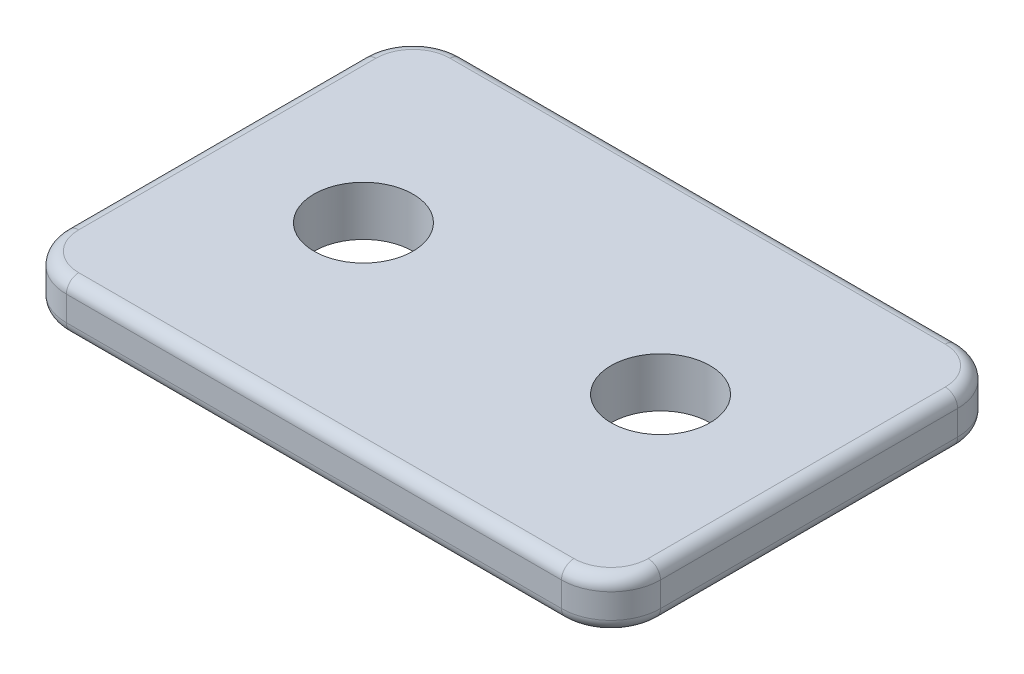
from build123d import *

# Parameters (mm, degrees)
SKETCH1_W          = 76.2
SKETCH1_H          = 6.35
BASE_EXTRUDE_DEPTH = 50.8
SKETCH2_R          = 6.35
CUT_EXTRUDE1_DEPTH = 92.800885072
FILLET1_R          = 6.35
FILLET2_R          = 1.5875


with BuildPart() as part:
    # Sketch1 → Base-Extrude (new body)
    with BuildSketch(Plane.XY):
        with Locations((38.1, 3.175)):
            Rectangle(SKETCH1_W, SKETCH1_H)
    extrude(amount=BASE_EXTRUDE_DEPTH)

    # Sketch2 → Cut-Extrude1 (cut, through all)
    with BuildSketch(Plane(origin=(0, 6.35, 0), x_dir=(-1, 0, 0), z_dir=(0, 1, 0))):
        with Locations((-57.15, 25.4)):
            Circle(SKETCH2_R)
        with Locations((-19.05, 25.4)):
            Circle(SKETCH2_R)
    extrude(amount=-CUT_EXTRUDE1_DEPTH, mode=Mode.SUBTRACT)

    # Fillet1
    fillet1_edges = [part.edges().sort_by_distance(p)[0] for p in [
        (76.2, 3.175, 50.8),
        (0, 3.175, 50.8),
        (76.2, 3.175, 0),
        (0, 3.175, 0),
    ]]
    fillet(fillet1_edges, radius=FILLET1_R)

    # Fillet2
    fillet2_edges = [part.edges().sort_by_distance(p)[0] for p in [
        (0, 0, 25.4),
        (0, 6.35, 25.4),
        (38.1, 6.35, 0),
        (38.1, 6.35, 50.8),
        (76.2, 6.35, 25.4),
        (74.340128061, 6.35, 48.940128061),
        (74.340128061, 6.35, 1.859871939),
        (1.859871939, 6.35, 1.859871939),
        (1.859871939, 6.35, 48.940128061),
        (38.1, 0, 50.8),
        (38.1, 0, 0),
        (76.2, 0, 25.4),
        (74.340128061, 0, 48.940128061),
        (74.340128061, 0, 1.859871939),
        (1.859871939, 0, 1.859871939),
        (1.859871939, 0, 48.940128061),
    ]]
    fillet(fillet2_edges, radius=FILLET2_R)


solid = part.part
